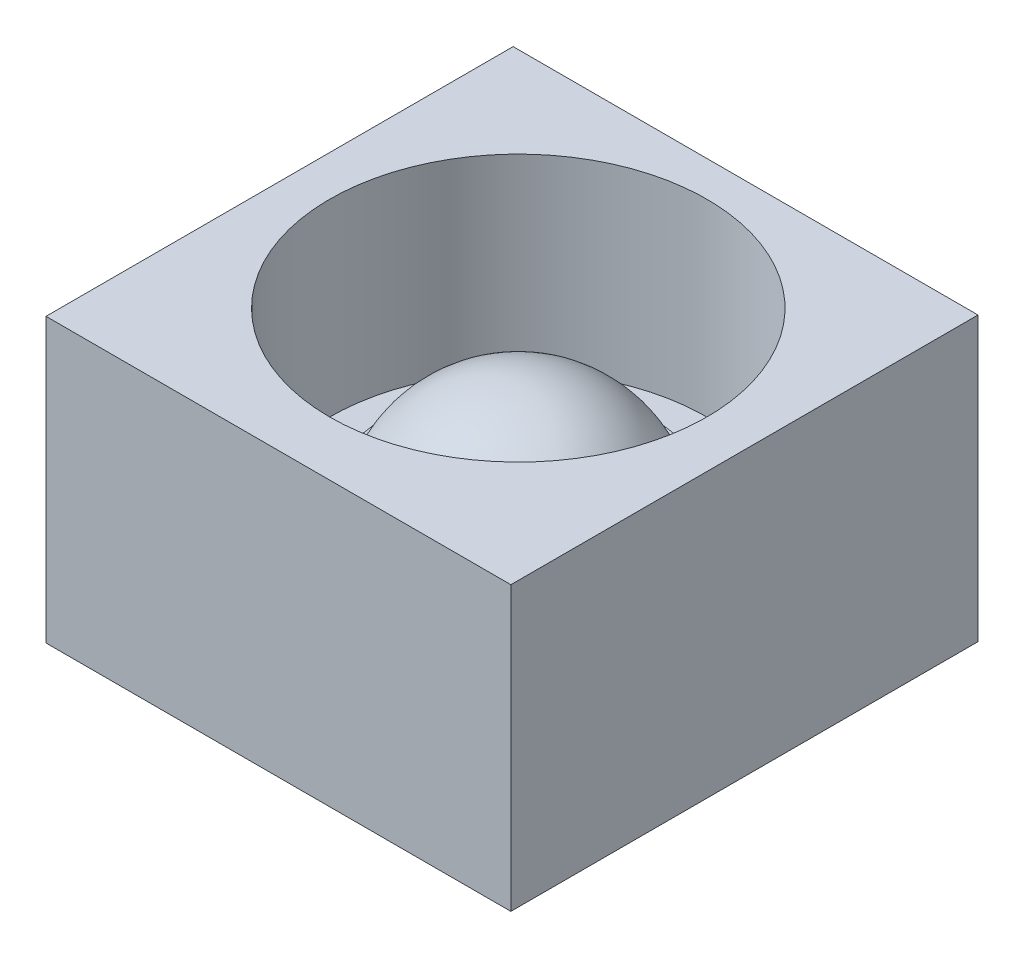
ISO-10303-21;
HEADER;
FILE_DESCRIPTION(('STEP AP214'),'2;1');
FILE_NAME('part.step','',(''),(''),'','','');
FILE_SCHEMA(('AUTOMOTIVE_DESIGN { 1 0 10303 214 1 1 1 1 }'));
ENDSEC;
DATA;
#1=APPLICATION_CONTEXT('core data for automotive mechanical design processes');
#2=APPLICATION_PROTOCOL_DEFINITION('international standard','automotive_design',2000,#1);
#3=PRODUCT_CONTEXT('',#1,'mechanical');
#4=PRODUCT('Part','Part','',(#3));
#5=PRODUCT_RELATED_PRODUCT_CATEGORY('part','',(#4));
#6=PRODUCT_DEFINITION_FORMATION('','',#4);
#7=PRODUCT_DEFINITION_CONTEXT('part definition',#1,'design');
#8=PRODUCT_DEFINITION('design','',#6,#7);
#9=PRODUCT_DEFINITION_SHAPE('','',#8);
#10=(LENGTH_UNIT() NAMED_UNIT(*) SI_UNIT(.MILLI.,.METRE.));
#11=(NAMED_UNIT(*) PLANE_ANGLE_UNIT() SI_UNIT($,.RADIAN.));
#12=(NAMED_UNIT(*) SI_UNIT($,.STERADIAN.) SOLID_ANGLE_UNIT());
#13=UNCERTAINTY_MEASURE_WITH_UNIT(LENGTH_MEASURE(1.E-05),#10,'distance_accuracy_value','');
#14=(GEOMETRIC_REPRESENTATION_CONTEXT(3) GLOBAL_UNCERTAINTY_ASSIGNED_CONTEXT((#13)) GLOBAL_UNIT_ASSIGNED_CONTEXT((#10,
#11,#12)) REPRESENTATION_CONTEXT('',''));
#15=CARTESIAN_POINT('',(0.,0.,0.));
#16=DIRECTION('',(0.,0.,1.));
#17=DIRECTION('',(1.,0.,0.));
#18=AXIS2_PLACEMENT_3D('',#15,#16,#17);
#19=CARTESIAN_POINT('',(-20.4381746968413,50.,-24.2788665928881));
#20=DIRECTION('',(1.,0.,0.));
#21=DIRECTION('',(0.,0.,-1.));
#22=AXIS2_PLACEMENT_3D('',#19,#20,#21);
#23=PLANE('',#22);
#24=DIRECTION('',(0.,0.,1.));
#25=VECTOR('',#24,1.);
#26=CARTESIAN_POINT('',(-20.4381746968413,20.,-24.2788665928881));
#27=LINE('',#26,#25);
#28=CARTESIAN_POINT('',(-20.4381746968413,20.,-24.2788665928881));
#29=VERTEX_POINT('',#28);
#30=CARTESIAN_POINT('',(-20.4381746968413,20.,25.2524552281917));
#31=VERTEX_POINT('',#30);
#32=EDGE_CURVE('E124',#29,#31,#27,.T.);
#33=ORIENTED_EDGE('',*,*,#32,.T.);
#34=DIRECTION('',(0.,-1.,0.));
#35=VECTOR('',#34,1.);
#36=CARTESIAN_POINT('',(-20.4381746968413,50.,25.2524552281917));
#37=LINE('',#36,#35);
#38=CARTESIAN_POINT('',(-20.4381746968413,50.,25.2524552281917));
#39=VERTEX_POINT('',#38);
#40=EDGE_CURVE('E13',#39,#31,#37,.T.);
#41=ORIENTED_EDGE('',*,*,#40,.F.);
#42=DIRECTION('',(0.,0.,1.));
#43=VECTOR('',#42,1.);
#44=CARTESIAN_POINT('',(-20.4381746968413,50.,-24.2788665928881));
#45=LINE('',#44,#43);
#46=CARTESIAN_POINT('',(-20.4381746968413,50.,-24.2788665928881));
#47=VERTEX_POINT('',#46);
#48=EDGE_CURVE('E144',#47,#39,#45,.T.);
#49=ORIENTED_EDGE('',*,*,#48,.F.);
#50=DIRECTION('',(0.,-1.,0.));
#51=VECTOR('',#50,1.);
#52=CARTESIAN_POINT('',(-20.4381746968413,50.,-24.2788665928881));
#53=LINE('',#52,#51);
#54=EDGE_CURVE('E149',#47,#29,#53,.T.);
#55=ORIENTED_EDGE('',*,*,#54,.T.);
#56=EDGE_LOOP('',(#33,#41,#49,#55));
#57=FACE_BOUND('',#56,.T.);
#58=ADVANCED_FACE('F68',(#57),#23,.F.);
#59=CARTESIAN_POINT('',(-20.4381746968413,50.,25.2524552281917));
#60=DIRECTION('',(0.,0.,-1.));
#61=DIRECTION('',(-1.,0.,0.));
#62=AXIS2_PLACEMENT_3D('',#59,#60,#61);
#63=PLANE('',#62);
#64=DIRECTION('',(1.,0.,0.));
#65=VECTOR('',#64,1.);
#66=CARTESIAN_POINT('',(-20.4381746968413,20.,25.2524552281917));
#67=LINE('',#66,#65);
#68=CARTESIAN_POINT('',(28.8497499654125,20.,25.2524552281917));
#69=VERTEX_POINT('',#68);
#70=EDGE_CURVE('E131',#31,#69,#67,.T.);
#71=ORIENTED_EDGE('',*,*,#70,.T.);
#72=DIRECTION('',(0.,-1.,0.));
#73=VECTOR('',#72,1.);
#74=CARTESIAN_POINT('',(28.8497499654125,50.,25.2524552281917));
#75=LINE('',#74,#73);
#76=CARTESIAN_POINT('',(28.8497499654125,50.,25.2524552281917));
#77=VERTEX_POINT('',#76);
#78=EDGE_CURVE('E76',#77,#69,#75,.T.);
#79=ORIENTED_EDGE('',*,*,#78,.F.);
#80=DIRECTION('',(1.,0.,0.));
#81=VECTOR('',#80,1.);
#82=CARTESIAN_POINT('',(-20.4381746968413,50.,25.2524552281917));
#83=LINE('',#82,#81);
#84=EDGE_CURVE('E115',#39,#77,#83,.T.);
#85=ORIENTED_EDGE('',*,*,#84,.F.);
#86=ORIENTED_EDGE('',*,*,#40,.T.);
#87=EDGE_LOOP('',(#71,#79,#85,#86));
#88=FACE_BOUND('',#87,.T.);
#89=ADVANCED_FACE('F174',(#88),#63,.F.);
#90=CARTESIAN_POINT('',(28.8497499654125,50.,-24.2788665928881));
#91=DIRECTION('',(-1.,0.,0.));
#92=DIRECTION('',(0.,0.,1.));
#93=AXIS2_PLACEMENT_3D('',#90,#91,#92);
#94=PLANE('',#93);
#95=DIRECTION('',(0.,0.,-1.));
#96=VECTOR('',#95,1.);
#97=CARTESIAN_POINT('',(28.8497499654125,20.,-24.2788665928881));
#98=LINE('',#97,#96);
#99=CARTESIAN_POINT('',(28.8497499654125,20.,-24.2788665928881));
#100=VERTEX_POINT('',#99);
#101=EDGE_CURVE('E102',#69,#100,#98,.T.);
#102=ORIENTED_EDGE('',*,*,#101,.T.);
#103=DIRECTION('',(0.,-1.,0.));
#104=VECTOR('',#103,1.);
#105=CARTESIAN_POINT('',(28.8497499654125,50.,-24.2788665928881));
#106=LINE('',#105,#104);
#107=CARTESIAN_POINT('',(28.8497499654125,50.,-24.2788665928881));
#108=VERTEX_POINT('',#107);
#109=EDGE_CURVE('E155',#108,#100,#106,.T.);
#110=ORIENTED_EDGE('',*,*,#109,.F.);
#111=DIRECTION('',(0.,0.,-1.));
#112=VECTOR('',#111,1.);
#113=CARTESIAN_POINT('',(28.8497499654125,50.,-24.2788665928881));
#114=LINE('',#113,#112);
#115=EDGE_CURVE('E147',#77,#108,#114,.T.);
#116=ORIENTED_EDGE('',*,*,#115,.F.);
#117=ORIENTED_EDGE('',*,*,#78,.T.);
#118=EDGE_LOOP('',(#102,#110,#116,#117));
#119=FACE_BOUND('',#118,.T.);
#120=ADVANCED_FACE('F157',(#119),#94,.F.);
#121=CARTESIAN_POINT('',(-20.4381746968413,50.,-24.2788665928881));
#122=DIRECTION('',(0.,0.,1.));
#123=DIRECTION('',(1.,0.,0.));
#124=AXIS2_PLACEMENT_3D('',#121,#122,#123);
#125=PLANE('',#124);
#126=DIRECTION('',(-1.,0.,0.));
#127=VECTOR('',#126,1.);
#128=CARTESIAN_POINT('',(-20.4381746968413,20.,-24.2788665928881));
#129=LINE('',#128,#127);
#130=EDGE_CURVE('E108',#100,#29,#129,.T.);
#131=ORIENTED_EDGE('',*,*,#130,.T.);
#132=ORIENTED_EDGE('',*,*,#54,.F.);
#133=DIRECTION('',(-1.,0.,0.));
#134=VECTOR('',#133,1.);
#135=CARTESIAN_POINT('',(-20.4381746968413,50.,-24.2788665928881));
#136=LINE('',#135,#134);
#137=EDGE_CURVE('E84',#108,#47,#136,.T.);
#138=ORIENTED_EDGE('',*,*,#137,.F.);
#139=ORIENTED_EDGE('',*,*,#109,.T.);
#140=EDGE_LOOP('',(#131,#132,#138,#139));
#141=FACE_BOUND('',#140,.T.);
#142=ADVANCED_FACE('F164',(#141),#125,.F.);
#143=CARTESIAN_POINT('',(0.,50.,0.));
#144=DIRECTION('',(0.,1.,0.));
#145=DIRECTION('',(0.,0.,1.));
#146=AXIS2_PLACEMENT_3D('',#143,#144,#145);
#147=PLANE('',#146);
#148=CARTESIAN_POINT('',(3.84476202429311,50.,-0.538934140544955));
#149=DIRECTION('',(0.,1.,0.));
#150=DIRECTION('',(-0.0812127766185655,0.,0.996696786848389));
#151=AXIS2_PLACEMENT_3D('',#148,#149,#150);
#152=CIRCLE('',#151,20.);
#153=CARTESIAN_POINT('',(2.2205064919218,50.,19.3950015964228));
#154=VERTEX_POINT('',#153);
#155=EDGE_CURVE('E138',#154,#154,#152,.T.);
#156=ORIENTED_EDGE('',*,*,#155,.F.);
#157=EDGE_LOOP('',(#156));
#158=FACE_BOUND('',#157,.T.);
#159=ORIENTED_EDGE('',*,*,#48,.T.);
#160=ORIENTED_EDGE('',*,*,#84,.T.);
#161=ORIENTED_EDGE('',*,*,#115,.T.);
#162=ORIENTED_EDGE('',*,*,#137,.T.);
#163=EDGE_LOOP('',(#159,#160,#161,#162));
#164=FACE_BOUND('',#163,.T.);
#165=ADVANCED_FACE('F166',(#158,#164),#147,.T.);
#166=CARTESIAN_POINT('',(0.,20.,0.));
#167=DIRECTION('',(0.,1.,0.));
#168=DIRECTION('',(0.,0.,1.));
#169=AXIS2_PLACEMENT_3D('',#166,#167,#168);
#170=PLANE('',#169);
#171=ORIENTED_EDGE('',*,*,#32,.F.);
#172=ORIENTED_EDGE('',*,*,#130,.F.);
#173=ORIENTED_EDGE('',*,*,#101,.F.);
#174=ORIENTED_EDGE('',*,*,#70,.F.);
#175=EDGE_LOOP('',(#171,#172,#173,#174));
#176=FACE_BOUND('',#175,.T.);
#177=ADVANCED_FACE('F160',(#176),#170,.F.);
#178=CARTESIAN_POINT('',(3.84476202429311,20.,-0.538934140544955));
#179=DIRECTION('',(0.,1.,0.));
#180=DIRECTION('',(-0.0812127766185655,0.,0.996696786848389));
#181=AXIS2_PLACEMENT_3D('',#178,#179,#180);
#182=CYLINDRICAL_SURFACE('',#181,20.);
#183=CARTESIAN_POINT('',(3.84476202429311,30.,-0.538934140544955));
#184=DIRECTION('',(0.,1.,0.));
#185=DIRECTION('',(-0.0812127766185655,0.,0.996696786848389));
#186=AXIS2_PLACEMENT_3D('',#183,#184,#185);
#187=CIRCLE('',#186,20.);
#188=CARTESIAN_POINT('',(2.2205064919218,30.,19.3950015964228));
#189=VERTEX_POINT('',#188);
#190=EDGE_CURVE('E141',#189,#189,#187,.F.);
#191=ORIENTED_EDGE('',*,*,#190,.T.);
#192=EDGE_LOOP('',(#191));
#193=FACE_BOUND('',#192,.T.);
#194=ORIENTED_EDGE('',*,*,#155,.T.);
#195=EDGE_LOOP('',(#194));
#196=FACE_BOUND('',#195,.T.);
#197=ADVANCED_FACE('F201',(#193,#196),#182,.F.);
#198=CARTESIAN_POINT('',(3.84476202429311,29.55,-0.538934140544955));
#199=DIRECTION('',(0.,-1.,0.));
#200=DIRECTION('',(0.996696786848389,0.,0.0812127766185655));
#201=AXIS2_PLACEMENT_3D('',#198,#199,#200);
#202=SPHERICAL_SURFACE('',#201,13.45);
#203=CARTESIAN_POINT('',(3.84476202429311,33.,-0.538934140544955));
#204=DIRECTION('',(0.,-1.,0.));
#205=DIRECTION('',(0.0812127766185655,0.,-0.996696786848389));
#206=AXIS2_PLACEMENT_3D('',#203,#204,#205);
#207=CIRCLE('',#206,13.);
#208=CARTESIAN_POINT('',(4.90052812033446,33.,-13.495992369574));
#209=VERTEX_POINT('',#208);
#210=EDGE_CURVE('E134',#209,#209,#207,.T.);
#211=ORIENTED_EDGE('',*,*,#210,.F.);
#212=EDGE_LOOP('',(#211));
#213=FACE_BOUND('',#212,.T.);
#214=ADVANCED_FACE('F214',(#213),#202,.T.);
#215=CARTESIAN_POINT('',(17.7985170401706,33.,0.598044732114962));
#216=DIRECTION('',(0.,1.,0.));
#217=DIRECTION('',(-0.0812127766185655,0.,0.996696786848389));
#218=AXIS2_PLACEMENT_3D('',#215,#216,#217);
#219=PLANE('',#218);
#220=ORIENTED_EDGE('',*,*,#210,.T.);
#221=EDGE_LOOP('',(#220));
#222=FACE_BOUND('',#221,.T.);
#223=CARTESIAN_POINT('',(3.84476202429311,33.,-0.538934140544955));
#224=DIRECTION('',(0.,-1.,0.));
#225=DIRECTION('',(0.0812127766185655,0.,-0.996696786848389));
#226=AXIS2_PLACEMENT_3D('',#223,#224,#225);
#227=CIRCLE('',#226,14.);
#228=CARTESIAN_POINT('',(4.98174089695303,33.,-14.4926891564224));
#229=VERTEX_POINT('',#228);
#230=EDGE_CURVE('E125',#229,#229,#227,.T.);
#231=ORIENTED_EDGE('',*,*,#230,.F.);
#232=EDGE_LOOP('',(#231));
#233=FACE_BOUND('',#232,.T.);
#234=ADVANCED_FACE('F224',(#222,#233),#219,.T.);
#235=CARTESIAN_POINT('',(3.84476202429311,30.,-0.538934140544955));
#236=DIRECTION('',(0.,-1.,0.));
#237=DIRECTION('',(0.0812127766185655,0.,-0.996696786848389));
#238=AXIS2_PLACEMENT_3D('',#235,#236,#237);
#239=CONICAL_SURFACE('',#238,15.,0.321750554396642);
#240=ORIENTED_EDGE('',*,*,#230,.T.);
#241=EDGE_LOOP('',(#240));
#242=FACE_BOUND('',#241,.T.);
#243=CARTESIAN_POINT('',(3.84476202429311,30.,-0.538934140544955));
#244=DIRECTION('',(0.,-1.,0.));
#245=DIRECTION('',(0.0812127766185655,0.,-0.996696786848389));
#246=AXIS2_PLACEMENT_3D('',#243,#244,#245);
#247=CIRCLE('',#246,15.);
#248=CARTESIAN_POINT('',(5.06295367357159,30.,-15.4893859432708));
#249=VERTEX_POINT('',#248);
#250=EDGE_CURVE('E120',#249,#249,#247,.T.);
#251=ORIENTED_EDGE('',*,*,#250,.F.);
#252=EDGE_LOOP('',(#251));
#253=FACE_BOUND('',#252,.T.);
#254=ADVANCED_FACE('F235',(#242,#253),#239,.T.);
#255=CARTESIAN_POINT('',(4.75181000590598,30.,-15.5147388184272));
#256=DIRECTION('',(0.,1.,0.));
#257=DIRECTION('',(0.996696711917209,0.,0.0812136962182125));
#258=AXIS2_PLACEMENT_3D('',#255,#256,#257);
#259=PLANE('',#258);
#260=ORIENTED_EDGE('',*,*,#190,.F.);
#261=EDGE_LOOP('',(#260));
#262=FACE_BOUND('',#261,.T.);
#263=ORIENTED_EDGE('',*,*,#250,.T.);
#264=EDGE_LOOP('',(#263));
#265=FACE_BOUND('',#264,.T.);
#266=ADVANCED_FACE('F121',(#262,#265),#259,.T.);
#267=CLOSED_SHELL('',(#58,#89,#120,#142,#165,#177,#197,#214,#234,#254,#266));
#268=MANIFOLD_SOLID_BREP('B2',#267);
#269=ADVANCED_BREP_SHAPE_REPRESENTATION('',(#18,#268),#14);
#270=SHAPE_DEFINITION_REPRESENTATION(#9,#269);
ENDSEC;
END-ISO-10303-21;
